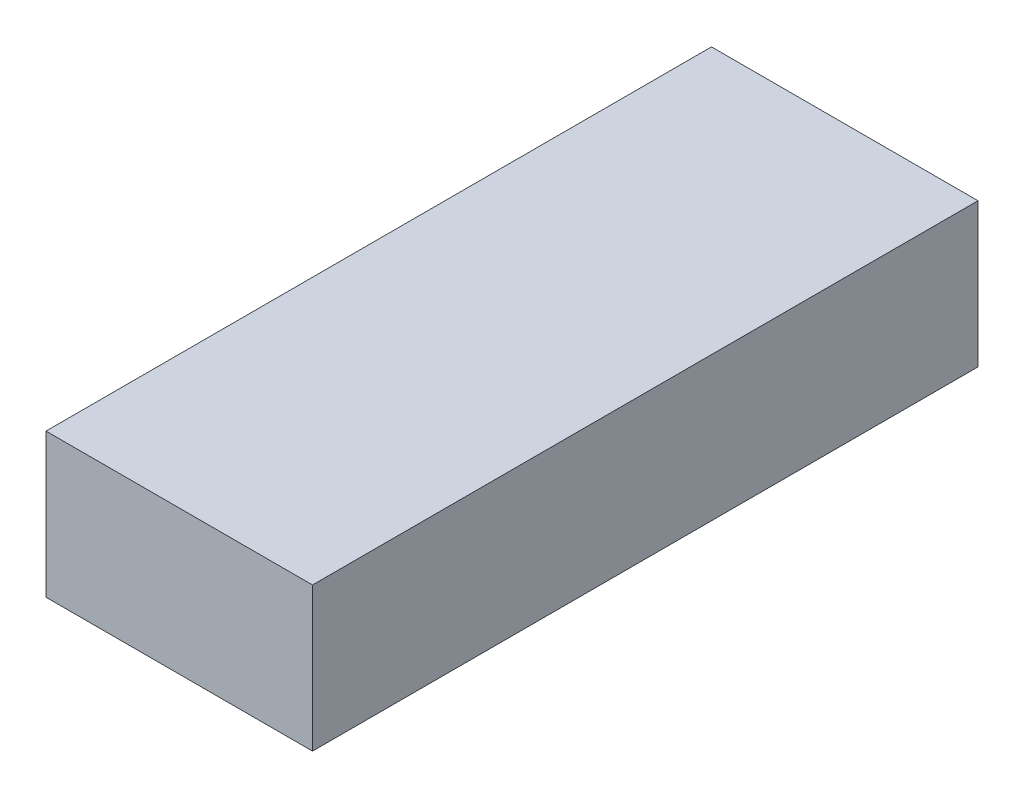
from build123d import *

# Parameters (mm, degrees)
SKETCH_1_W      = 10
SKETCH_1_H      = 5.4
EXTRUDE_1_DEPTH = 24.97


with BuildPart() as part:
    # Sketch 1 → Extrude 1 (new body)
    with BuildSketch(Plane.XY):
        with Locations((1.056801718, 1.630398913)):
            Rectangle(SKETCH_1_W, SKETCH_1_H)
    extrude(amount=EXTRUDE_1_DEPTH)


solid = part.part
